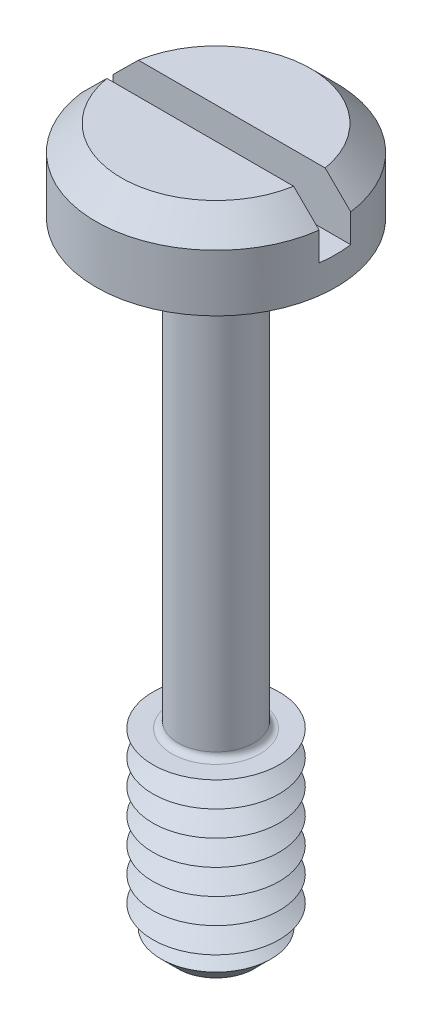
ISO-10303-21;
HEADER;
FILE_DESCRIPTION(('STEP AP214'),'2;1');
FILE_NAME('part.step','',(''),(''),'','','');
FILE_SCHEMA(('AUTOMOTIVE_DESIGN { 1 0 10303 214 1 1 1 1 }'));
ENDSEC;
DATA;
#1=APPLICATION_CONTEXT('core data for automotive mechanical design processes');
#2=APPLICATION_PROTOCOL_DEFINITION('international standard','automotive_design',2000,#1);
#3=PRODUCT_CONTEXT('',#1,'mechanical');
#4=PRODUCT('Part','Part','',(#3));
#5=PRODUCT_RELATED_PRODUCT_CATEGORY('part','',(#4));
#6=PRODUCT_DEFINITION_FORMATION('','',#4);
#7=PRODUCT_DEFINITION_CONTEXT('part definition',#1,'design');
#8=PRODUCT_DEFINITION('design','',#6,#7);
#9=PRODUCT_DEFINITION_SHAPE('','',#8);
#10=(LENGTH_UNIT() NAMED_UNIT(*) SI_UNIT(.MILLI.,.METRE.));
#11=(NAMED_UNIT(*) PLANE_ANGLE_UNIT() SI_UNIT($,.RADIAN.));
#12=(NAMED_UNIT(*) SI_UNIT($,.STERADIAN.) SOLID_ANGLE_UNIT());
#13=UNCERTAINTY_MEASURE_WITH_UNIT(LENGTH_MEASURE(1.E-05),#10,'distance_accuracy_value','');
#14=(GEOMETRIC_REPRESENTATION_CONTEXT(3) GLOBAL_UNCERTAINTY_ASSIGNED_CONTEXT((#13)) GLOBAL_UNIT_ASSIGNED_CONTEXT((#10,
#11,#12)) REPRESENTATION_CONTEXT('',''));
#15=CARTESIAN_POINT('',(0.,0.,0.));
#16=DIRECTION('',(0.,0.,1.));
#17=DIRECTION('',(1.,0.,0.));
#18=AXIS2_PLACEMENT_3D('',#15,#16,#17);
#19=CARTESIAN_POINT('',(0.,1.3,0.));
#20=DIRECTION('',(0.,1.,0.));
#21=DIRECTION('',(0.,0.,1.));
#22=AXIS2_PLACEMENT_3D('',#19,#20,#21);
#23=PLANE('',#22);
#24=DIRECTION('',(-1.,0.,0.));
#25=VECTOR('',#24,1.);
#26=CARTESIAN_POINT('',(1.9,1.3,-0.25));
#27=LINE('',#26,#25);
#28=CARTESIAN_POINT('',(1.4790199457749,1.3,-0.25));
#29=VERTEX_POINT('',#28);
#30=CARTESIAN_POINT('',(-1.4790199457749,1.3,-0.25));
#31=VERTEX_POINT('',#30);
#32=EDGE_CURVE('E109',#29,#31,#27,.T.);
#33=ORIENTED_EDGE('',*,*,#32,.F.);
#34=CARTESIAN_POINT('',(0.,1.3,0.));
#35=DIRECTION('',(0.,1.,0.));
#36=DIRECTION('',(0.,0.,1.));
#37=AXIS2_PLACEMENT_3D('',#34,#35,#36);
#38=CIRCLE('',#37,1.5);
#39=EDGE_CURVE('E112',#29,#31,#38,.T.);
#40=ORIENTED_EDGE('',*,*,#39,.T.);
#41=EDGE_LOOP('',(#33,#40));
#42=FACE_BOUND('',#41,.T.);
#43=ADVANCED_FACE('F38',(#42),#23,.T.);
#44=CARTESIAN_POINT('',(0.,1.3,0.));
#45=DIRECTION('',(0.,-1.,0.));
#46=DIRECTION('',(0.,0.,-1.));
#47=AXIS2_PLACEMENT_3D('',#44,#45,#46);
#48=CONICAL_SURFACE('',#47,1.5,0.785398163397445);
#49=CARTESIAN_POINT('',(4.1853368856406,-1.39279678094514,-0.25));
#50=CARTESIAN_POINT('',(4.04229038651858,-1.25000682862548,-0.25));
#51=CARTESIAN_POINT('',(3.89923277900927,-1.10722799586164,-0.25));
#52=CARTESIAN_POINT('',(3.613079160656,-0.82170490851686,-0.25));
#53=CARTESIAN_POINT('',(3.46998314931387,-0.678960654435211,-0.25));
#54=CARTESIAN_POINT('',(3.1836962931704,-0.393478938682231,-0.25));
#55=CARTESIAN_POINT('',(3.04050543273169,-0.25074149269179,-0.25));
#56=CARTESIAN_POINT('',(2.75404923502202,0.0346548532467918,-0.25));
#57=CARTESIAN_POINT('',(2.61078389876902,0.177313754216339,-0.25));
#58=CARTESIAN_POINT('',(2.32055190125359,0.466067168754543,-0.25));
#59=CARTESIAN_POINT('',(2.17358212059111,0.612158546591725,-0.25));
#60=CARTESIAN_POINT('',(1.87941274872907,0.904121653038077,-0.25));
#61=CARTESIAN_POINT('',(1.73221314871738,1.04999337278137,-0.25));
#62=CARTESIAN_POINT('',(1.51107316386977,1.26842721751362,-0.25));
#63=CARTESIAN_POINT('',(1.43731034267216,1.34116907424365,-0.25));
#64=CARTESIAN_POINT('',(1.28959621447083,1.48646381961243,-0.25));
#65=CARTESIAN_POINT('',(1.21564490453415,1.55901670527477,-0.25));
#66=CARTESIAN_POINT('',(1.06743357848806,1.7037953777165,-0.25));
#67=CARTESIAN_POINT('',(0.993173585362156,1.77602118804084,-0.25));
#68=CARTESIAN_POINT('',(0.844093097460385,1.91989140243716,-0.25));
#69=CARTESIAN_POINT('',(0.769272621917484,1.99153582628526,-0.25));
#70=CARTESIAN_POINT('',(0.673453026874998,2.0816726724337,-0.25));
#71=CARTESIAN_POINT('',(0.653038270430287,2.10078477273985,-0.25));
#72=CARTESIAN_POINT('',(0.612082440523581,2.13887320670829,-0.25));
#73=CARTESIAN_POINT('',(0.591541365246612,2.15784953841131,-0.25));
#74=CARTESIAN_POINT('',(0.529771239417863,2.21444296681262,-0.25));
#75=CARTESIAN_POINT('',(0.488307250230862,2.25180787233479,-0.25));
#76=CARTESIAN_POINT('',(0.419663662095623,2.31168392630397,-0.25));
#77=CARTESIAN_POINT('',(0.392840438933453,2.33460285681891,-0.25));
#78=CARTESIAN_POINT('',(0.33832923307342,2.37961554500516,-0.25));
#79=CARTESIAN_POINT('',(0.310638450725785,2.40170598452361,-0.25));
#80=CARTESIAN_POINT('',(0.267983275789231,2.43362951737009,-0.25));
#81=CARTESIAN_POINT('',(0.253509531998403,2.44411383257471,-0.25));
#82=CARTESIAN_POINT('',(0.224109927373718,2.46442369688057,-0.25));
#83=CARTESIAN_POINT('',(0.209184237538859,2.47424949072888,-0.25));
#84=CARTESIAN_POINT('',(0.178776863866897,2.49288890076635,-0.25));
#85=CARTESIAN_POINT('',(0.163297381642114,2.50170604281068,-0.25));
#86=CARTESIAN_POINT('',(0.131578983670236,2.51781823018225,-0.25));
#87=CARTESIAN_POINT('',(0.115341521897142,2.52511605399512,-0.25));
#88=CARTESIAN_POINT('',(0.081699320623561,2.53745946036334,-0.25));
#89=CARTESIAN_POINT('',(0.0642805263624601,2.54246888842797,-0.25));
#90=CARTESIAN_POINT('',(0.0288639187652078,2.54892929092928,-0.25));
#91=CARTESIAN_POINT('',(0.0108708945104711,2.55040442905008,-0.25));
#92=CARTESIAN_POINT('',(-0.0250443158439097,2.54939473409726,-0.25));
#93=CARTESIAN_POINT('',(-0.0429661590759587,2.54689872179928,-0.25));
#94=CARTESIAN_POINT('',(-0.0781147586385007,2.53864961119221,-0.25));
#95=CARTESIAN_POINT('',(-0.0953356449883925,2.53287340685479,-0.25));
#96=CARTESIAN_POINT('',(-0.132199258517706,2.51779776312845,-0.25));
#97=CARTESIAN_POINT('',(-0.151639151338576,2.50802516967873,-0.25));
#98=CARTESIAN_POINT('',(-0.189519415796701,2.48667393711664,-0.25));
#99=CARTESIAN_POINT('',(-0.207957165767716,2.47509084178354,-0.25));
#100=CARTESIAN_POINT('',(-0.244227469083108,2.45076455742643,-0.25));
#101=CARTESIAN_POINT('',(-0.262054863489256,2.4380137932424,-0.25));
#102=CARTESIAN_POINT('',(-0.297164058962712,2.41183569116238,-0.25));
#103=CARTESIAN_POINT('',(-0.314446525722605,2.39840923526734,-0.25));
#104=CARTESIAN_POINT('',(-0.371053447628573,2.35323015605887,-0.25));
#105=CARTESIAN_POINT('',(-0.409598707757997,2.32050831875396,-0.25));
#106=CARTESIAN_POINT('',(-0.485753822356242,2.25398879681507,-0.25));
#107=CARTESIAN_POINT('',(-0.523363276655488,2.22019066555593,-0.25));
#108=CARTESIAN_POINT('',(-0.598084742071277,2.15194710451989,-0.25));
#109=CARTESIAN_POINT('',(-0.63519600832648,2.11750085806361,-0.25));
#110=CARTESIAN_POINT('',(-0.709072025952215,2.0482548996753,-0.25));
#111=CARTESIAN_POINT('',(-0.745836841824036,2.01345525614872,-0.25));
#112=CARTESIAN_POINT('',(-0.855349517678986,1.9091458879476,-0.25));
#113=CARTESIAN_POINT('',(-0.927775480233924,1.83929849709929,-0.25));
#114=CARTESIAN_POINT('',(-1.07215273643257,1.69921833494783,-0.25));
#115=CARTESIAN_POINT('',(-1.14410432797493,1.62898586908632,-0.25));
#116=CARTESIAN_POINT('',(-1.33992197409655,1.43719038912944,-0.25));
#117=CARTESIAN_POINT('',(-1.46354933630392,1.31538371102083,-0.25));
#118=CARTESIAN_POINT('',(-1.71048263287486,1.07144356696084,-0.25));
#119=CARTESIAN_POINT('',(-1.83378856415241,0.949310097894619,-0.25));
#120=CARTESIAN_POINT('',(-2.20352581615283,0.582566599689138,-0.25));
#121=CARTESIAN_POINT('',(-2.44969583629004,0.337693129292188,-0.25));
#122=CARTESIAN_POINT('',(-2.94423335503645,-0.154747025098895,-0.25));
#123=CARTESIAN_POINT('',(-3.19259832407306,-0.402316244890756,-0.25));
#124=CARTESIAN_POINT('',(-3.68909403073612,-0.897516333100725,-0.25));
#125=CARTESIAN_POINT('',(-3.93722481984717,-1.14514714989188,-0.25));
#126=CARTESIAN_POINT('',(-4.1853368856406,-1.39279678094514,-0.25));
#127=B_SPLINE_CURVE_WITH_KNOTS('',3,(#49,#50,#51,#52,#53,#54,#55,#56,#57,#58,#59,#60,#61,#62,
#63,#64,#65,#66,#67,#68,#69,#70,#71,#72,#73,#74,#75,#76,#77,#78,#79,#80,#81,#82,#83,#84,#85,#86,
#87,#88,#89,#90,#91,#92,#93,#94,#95,#96,#97,#98,#99,#100,#101,#102,#103,#104,#105,#106,#107,
#108,#109,#110,#111,#112,#113,#114,#115,#116,#117,#118,#119,#120,#121,#122,#123,#124,#125,#126),
.UNSPECIFIED.,.F.,.F.,(4,2,2,2,2,2,2,2,2,2,2,2,2,2,2,2,2,2,2,2,2,2,2,2,2,2,2,2,2,2,2,2,2,2,2,2,
2,2,4),(0.,0.606350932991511,1.2127101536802,1.81925643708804,2.42579463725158,3.04747398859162,
3.66917779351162,3.97996857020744,4.29076421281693,4.60153711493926,4.91229940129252,
4.99619332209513,5.08008845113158,5.24751495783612,5.35335108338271,5.45957361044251,
5.51317784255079,5.56676204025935,5.62015280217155,5.67344504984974,5.72755238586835,
5.78128872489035,5.83517660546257,5.88944887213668,5.95455572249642,6.01982542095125,
6.08555345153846,6.15119780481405,6.30282427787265,6.45451451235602,6.60641073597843,
6.75827809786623,7.06012987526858,7.36176945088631,7.88242595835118,8.40308744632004,
9.44475070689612,10.4967873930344,11.5484571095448),.UNSPECIFIED.);
#128=CARTESIAN_POINT('',(1.88348082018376,0.899999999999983,-0.25));
#129=VERTEX_POINT('',#128);
#130=EDGE_CURVE('E251',#129,#29,#127,.T.);
#131=ORIENTED_EDGE('',*,*,#130,.F.);
#132=CARTESIAN_POINT('',(0.,0.899999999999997,0.));
#133=DIRECTION('',(0.,1.,0.));
#134=DIRECTION('',(0.,0.,1.));
#135=AXIS2_PLACEMENT_3D('',#132,#133,#134);
#136=CIRCLE('',#135,1.9);
#137=CARTESIAN_POINT('',(-1.88348082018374,0.899999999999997,-0.25));
#138=VERTEX_POINT('',#137);
#139=EDGE_CURVE('E127',#138,#129,#136,.F.);
#140=ORIENTED_EDGE('',*,*,#139,.F.);
#141=EDGE_CURVE('E101',#31,#138,#127,.T.);
#142=ORIENTED_EDGE('',*,*,#141,.F.);
#143=ORIENTED_EDGE('',*,*,#39,.F.);
#144=EDGE_LOOP('',(#131,#140,#142,#143));
#145=FACE_BOUND('',#144,.T.);
#146=ADVANCED_FACE('F213',(#145),#48,.T.);
#147=CARTESIAN_POINT('',(0.,-10.,0.));
#148=DIRECTION('',(0.,1.,0.));
#149=DIRECTION('',(0.,0.,1.));
#150=AXIS2_PLACEMENT_3D('',#147,#148,#149);
#151=CYLINDRICAL_SURFACE('',#150,0.6);
#152=CARTESIAN_POINT('',(0.,-6.9,0.));
#153=DIRECTION('',(0.,-1.,0.));
#154=DIRECTION('',(0.,0.,-1.));
#155=AXIS2_PLACEMENT_3D('',#152,#153,#154);
#156=CIRCLE('',#155,0.6);
#157=CARTESIAN_POINT('',(0.,-6.9,-0.6));
#158=VERTEX_POINT('',#157);
#159=EDGE_CURVE('E122',#158,#158,#156,.F.);
#160=ORIENTED_EDGE('',*,*,#159,.T.);
#161=EDGE_LOOP('',(#160));
#162=FACE_BOUND('',#161,.T.);
#163=CARTESIAN_POINT('',(0.,-0.0999999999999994,0.));
#164=DIRECTION('',(0.,1.,0.));
#165=DIRECTION('',(0.,0.,1.));
#166=AXIS2_PLACEMENT_3D('',#163,#164,#165);
#167=CIRCLE('',#166,0.6);
#168=CARTESIAN_POINT('',(0.,-0.0999999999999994,0.6));
#169=VERTEX_POINT('',#168);
#170=EDGE_CURVE('E348',#169,#169,#167,.F.);
#171=ORIENTED_EDGE('',*,*,#170,.T.);
#172=EDGE_LOOP('',(#171));
#173=FACE_BOUND('',#172,.T.);
#174=ADVANCED_FACE('F209',(#162,#173),#151,.T.);
#175=CARTESIAN_POINT('',(0.,1.3,0.));
#176=DIRECTION('',(0.,-1.,0.));
#177=DIRECTION('',(0.,0.,-1.));
#178=AXIS2_PLACEMENT_3D('',#175,#176,#177);
#179=CYLINDRICAL_SURFACE('',#178,1.9);
#180=ORIENTED_EDGE('',*,*,#139,.T.);
#181=DIRECTION('',(0.,-1.,0.));
#182=VECTOR('',#181,1.);
#183=CARTESIAN_POINT('',(1.88348082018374,1.3,-0.25));
#184=LINE('',#183,#182);
#185=CARTESIAN_POINT('',(1.88348082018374,0.45,-0.25));
#186=VERTEX_POINT('',#185);
#187=EDGE_CURVE('E63',#129,#186,#184,.T.);
#188=ORIENTED_EDGE('',*,*,#187,.T.);
#189=CARTESIAN_POINT('',(0.,0.45,0.));
#190=DIRECTION('',(0.,1.,0.));
#191=DIRECTION('',(0.,0.,1.));
#192=AXIS2_PLACEMENT_3D('',#189,#190,#191);
#193=CIRCLE('',#192,1.9);
#194=CARTESIAN_POINT('',(1.88348082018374,0.45,0.25));
#195=VERTEX_POINT('',#194);
#196=EDGE_CURVE('E11',#195,#186,#193,.T.);
#197=ORIENTED_EDGE('',*,*,#196,.F.);
#198=DIRECTION('',(0.,-1.,0.));
#199=VECTOR('',#198,1.);
#200=CARTESIAN_POINT('',(1.88348082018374,1.3,0.25));
#201=LINE('',#200,#199);
#202=CARTESIAN_POINT('',(1.88348082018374,0.899999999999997,0.25));
#203=VERTEX_POINT('',#202);
#204=EDGE_CURVE('E266',#195,#203,#201,.F.);
#205=ORIENTED_EDGE('',*,*,#204,.T.);
#206=CARTESIAN_POINT('',(-1.88348082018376,0.899999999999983,0.25));
#207=VERTEX_POINT('',#206);
#208=EDGE_CURVE('E119',#203,#207,#136,.F.);
#209=ORIENTED_EDGE('',*,*,#208,.T.);
#210=DIRECTION('',(0.,-1.,0.));
#211=VECTOR('',#210,1.);
#212=CARTESIAN_POINT('',(-1.88348082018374,1.3,0.25));
#213=LINE('',#212,#211);
#214=CARTESIAN_POINT('',(-1.88348082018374,0.45,0.25));
#215=VERTEX_POINT('',#214);
#216=EDGE_CURVE('E95',#207,#215,#213,.T.);
#217=ORIENTED_EDGE('',*,*,#216,.T.);
#218=CARTESIAN_POINT('',(-1.88348082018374,0.45,-0.25));
#219=VERTEX_POINT('',#218);
#220=EDGE_CURVE('E43',#219,#215,#193,.T.);
#221=ORIENTED_EDGE('',*,*,#220,.F.);
#222=DIRECTION('',(0.,-1.,0.));
#223=VECTOR('',#222,1.);
#224=CARTESIAN_POINT('',(-1.88348082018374,1.3,-0.25));
#225=LINE('',#224,#223);
#226=EDGE_CURVE('E270',#219,#138,#225,.F.);
#227=ORIENTED_EDGE('',*,*,#226,.T.);
#228=EDGE_LOOP('',(#180,#188,#197,#205,#209,#217,#221,#227));
#229=FACE_BOUND('',#228,.T.);
#230=CARTESIAN_POINT('',(0.,0.,0.));
#231=DIRECTION('',(0.,1.,0.));
#232=DIRECTION('',(0.,0.,1.));
#233=AXIS2_PLACEMENT_3D('',#230,#231,#232);
#234=CIRCLE('',#233,1.9);
#235=CARTESIAN_POINT('',(0.,0.,1.9));
#236=VERTEX_POINT('',#235);
#237=EDGE_CURVE('E334',#236,#236,#234,.T.);
#238=ORIENTED_EDGE('',*,*,#237,.T.);
#239=EDGE_LOOP('',(#238));
#240=FACE_BOUND('',#239,.T.);
#241=ADVANCED_FACE('F212',(#229,#240),#179,.T.);
#242=DIRECTION('',(1.,0.,0.));
#243=VECTOR('',#242,1.);
#244=CARTESIAN_POINT('',(1.9,1.3,0.25));
#245=LINE('',#244,#243);
#246=CARTESIAN_POINT('',(-1.4790199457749,1.3,0.25));
#247=VERTEX_POINT('',#246);
#248=CARTESIAN_POINT('',(1.4790199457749,1.3,0.25));
#249=VERTEX_POINT('',#248);
#250=EDGE_CURVE('E55',#247,#249,#245,.T.);
#251=ORIENTED_EDGE('',*,*,#250,.F.);
#252=EDGE_CURVE('E107',#247,#249,#38,.T.);
#253=ORIENTED_EDGE('',*,*,#252,.T.);
#254=EDGE_LOOP('',(#251,#253));
#255=FACE_BOUND('',#254,.T.);
#256=ADVANCED_FACE('F106',(#255),#23,.T.);
#257=CARTESIAN_POINT('',(0.,0.,0.));
#258=DIRECTION('',(0.,1.,0.));
#259=DIRECTION('',(0.,0.,1.));
#260=AXIS2_PLACEMENT_3D('',#257,#258,#259);
#261=PLANE('',#260);
#262=CARTESIAN_POINT('',(0.,0.,0.));
#263=DIRECTION('',(0.,1.,0.));
#264=DIRECTION('',(0.,0.,1.));
#265=AXIS2_PLACEMENT_3D('',#262,#263,#264);
#266=CIRCLE('',#265,0.7);
#267=CARTESIAN_POINT('',(0.,0.,0.7));
#268=VERTEX_POINT('',#267);
#269=EDGE_CURVE('E113',#268,#268,#266,.T.);
#270=ORIENTED_EDGE('',*,*,#269,.T.);
#271=EDGE_LOOP('',(#270));
#272=FACE_BOUND('',#271,.T.);
#273=ORIENTED_EDGE('',*,*,#237,.F.);
#274=EDGE_LOOP('',(#273));
#275=FACE_BOUND('',#274,.T.);
#276=ADVANCED_FACE('F203',(#272,#275),#261,.F.);
#277=CARTESIAN_POINT('',(0.,-7.,0.));
#278=DIRECTION('',(0.,-1.,0.));
#279=DIRECTION('',(0.,0.,-1.));
#280=AXIS2_PLACEMENT_3D('',#277,#278,#279);
#281=PLANE('',#280);
#282=CARTESIAN_POINT('',(0.,-7.,0.));
#283=DIRECTION('',(0.,-1.,0.));
#284=DIRECTION('',(0.,0.,-1.));
#285=AXIS2_PLACEMENT_3D('',#282,#283,#284);
#286=CIRCLE('',#285,0.7);
#287=CARTESIAN_POINT('',(0.,-7.,-0.7));
#288=VERTEX_POINT('',#287);
#289=EDGE_CURVE('E341',#288,#288,#286,.T.);
#290=ORIENTED_EDGE('',*,*,#289,.T.);
#291=EDGE_LOOP('',(#290));
#292=FACE_BOUND('',#291,.T.);
#293=CARTESIAN_POINT('',(0.,-7.,0.));
#294=DIRECTION('',(0.,1.,0.));
#295=DIRECTION('',(0.,0.,1.));
#296=AXIS2_PLACEMENT_3D('',#293,#294,#295);
#297=CIRCLE('',#296,1.);
#298=CARTESIAN_POINT('',(0.,-7.,1.));
#299=VERTEX_POINT('',#298);
#300=EDGE_CURVE('E330',#299,#299,#297,.T.);
#301=ORIENTED_EDGE('',*,*,#300,.T.);
#302=EDGE_LOOP('',(#301));
#303=FACE_BOUND('',#302,.T.);
#304=ADVANCED_FACE('F199',(#292,#303),#281,.F.);
#305=CARTESIAN_POINT('',(0.,-7.2,0.));
#306=DIRECTION('',(0.,1.,0.));
#307=DIRECTION('',(0.,0.,1.));
#308=AXIS2_PLACEMENT_3D('',#305,#306,#307);
#309=CONICAL_SURFACE('',#308,0.653589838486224,1.0471975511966);
#310=ORIENTED_EDGE('',*,*,#300,.F.);
#311=EDGE_LOOP('',(#310));
#312=FACE_BOUND('',#311,.T.);
#313=CARTESIAN_POINT('',(0.,-7.2,0.));
#314=DIRECTION('',(0.,1.,0.));
#315=DIRECTION('',(0.,0.,1.));
#316=AXIS2_PLACEMENT_3D('',#313,#314,#315);
#317=CIRCLE('',#316,0.653589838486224);
#318=CARTESIAN_POINT('',(0.,-7.2,0.653589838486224));
#319=VERTEX_POINT('',#318);
#320=EDGE_CURVE('E326',#319,#319,#317,.T.);
#321=ORIENTED_EDGE('',*,*,#320,.T.);
#322=EDGE_LOOP('',(#321));
#323=FACE_BOUND('',#322,.T.);
#324=ADVANCED_FACE('F195',(#312,#323),#309,.T.);
#325=CARTESIAN_POINT('',(0.,-7.4,0.));
#326=DIRECTION('',(0.,-1.,0.));
#327=DIRECTION('',(0.,0.,-1.));
#328=AXIS2_PLACEMENT_3D('',#325,#326,#327);
#329=CONICAL_SURFACE('',#328,1.,1.0471975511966);
#330=ORIENTED_EDGE('',*,*,#320,.F.);
#331=EDGE_LOOP('',(#330));
#332=FACE_BOUND('',#331,.T.);
#333=CARTESIAN_POINT('',(0.,-7.4,0.));
#334=DIRECTION('',(0.,1.,0.));
#335=DIRECTION('',(0.,0.,1.));
#336=AXIS2_PLACEMENT_3D('',#333,#334,#335);
#337=CIRCLE('',#336,1.);
#338=CARTESIAN_POINT('',(0.,-7.4,1.));
#339=VERTEX_POINT('',#338);
#340=EDGE_CURVE('E323',#339,#339,#337,.T.);
#341=ORIENTED_EDGE('',*,*,#340,.T.);
#342=EDGE_LOOP('',(#341));
#343=FACE_BOUND('',#342,.T.);
#344=ADVANCED_FACE('F191',(#332,#343),#329,.T.);
#345=CARTESIAN_POINT('',(0.,-7.6,0.));
#346=DIRECTION('',(0.,1.,0.));
#347=DIRECTION('',(0.,0.,1.));
#348=AXIS2_PLACEMENT_3D('',#345,#346,#347);
#349=CONICAL_SURFACE('',#348,0.653589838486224,1.0471975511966);
#350=ORIENTED_EDGE('',*,*,#340,.F.);
#351=EDGE_LOOP('',(#350));
#352=FACE_BOUND('',#351,.T.);
#353=CARTESIAN_POINT('',(0.,-7.6,0.));
#354=DIRECTION('',(0.,1.,0.));
#355=DIRECTION('',(0.,0.,1.));
#356=AXIS2_PLACEMENT_3D('',#353,#354,#355);
#357=CIRCLE('',#356,0.653589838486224);
#358=CARTESIAN_POINT('',(0.,-7.6,0.653589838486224));
#359=VERTEX_POINT('',#358);
#360=EDGE_CURVE('E319',#359,#359,#357,.T.);
#361=ORIENTED_EDGE('',*,*,#360,.T.);
#362=EDGE_LOOP('',(#361));
#363=FACE_BOUND('',#362,.T.);
#364=ADVANCED_FACE('F187',(#352,#363),#349,.T.);
#365=CARTESIAN_POINT('',(0.,-7.8,0.));
#366=DIRECTION('',(0.,-1.,0.));
#367=DIRECTION('',(0.,0.,-1.));
#368=AXIS2_PLACEMENT_3D('',#365,#366,#367);
#369=CONICAL_SURFACE('',#368,1.,1.0471975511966);
#370=ORIENTED_EDGE('',*,*,#360,.F.);
#371=EDGE_LOOP('',(#370));
#372=FACE_BOUND('',#371,.T.);
#373=CARTESIAN_POINT('',(0.,-7.8,0.));
#374=DIRECTION('',(0.,1.,0.));
#375=DIRECTION('',(0.,0.,1.));
#376=AXIS2_PLACEMENT_3D('',#373,#374,#375);
#377=CIRCLE('',#376,1.);
#378=CARTESIAN_POINT('',(0.,-7.8,1.));
#379=VERTEX_POINT('',#378);
#380=EDGE_CURVE('E315',#379,#379,#377,.T.);
#381=ORIENTED_EDGE('',*,*,#380,.T.);
#382=EDGE_LOOP('',(#381));
#383=FACE_BOUND('',#382,.T.);
#384=ADVANCED_FACE('F183',(#372,#383),#369,.T.);
#385=CARTESIAN_POINT('',(0.,-8.,0.));
#386=DIRECTION('',(0.,1.,0.));
#387=DIRECTION('',(0.,0.,1.));
#388=AXIS2_PLACEMENT_3D('',#385,#386,#387);
#389=CONICAL_SURFACE('',#388,0.653589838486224,1.0471975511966);
#390=ORIENTED_EDGE('',*,*,#380,.F.);
#391=EDGE_LOOP('',(#390));
#392=FACE_BOUND('',#391,.T.);
#393=CARTESIAN_POINT('',(0.,-8.,0.));
#394=DIRECTION('',(0.,1.,0.));
#395=DIRECTION('',(0.,0.,1.));
#396=AXIS2_PLACEMENT_3D('',#393,#394,#395);
#397=CIRCLE('',#396,0.653589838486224);
#398=CARTESIAN_POINT('',(0.,-8.,0.653589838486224));
#399=VERTEX_POINT('',#398);
#400=EDGE_CURVE('E311',#399,#399,#397,.T.);
#401=ORIENTED_EDGE('',*,*,#400,.T.);
#402=EDGE_LOOP('',(#401));
#403=FACE_BOUND('',#402,.T.);
#404=ADVANCED_FACE('F179',(#392,#403),#389,.T.);
#405=CARTESIAN_POINT('',(0.,-8.2,0.));
#406=DIRECTION('',(0.,-1.,0.));
#407=DIRECTION('',(0.,0.,-1.));
#408=AXIS2_PLACEMENT_3D('',#405,#406,#407);
#409=CONICAL_SURFACE('',#408,1.,1.0471975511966);
#410=ORIENTED_EDGE('',*,*,#400,.F.);
#411=EDGE_LOOP('',(#410));
#412=FACE_BOUND('',#411,.T.);
#413=CARTESIAN_POINT('',(0.,-8.2,0.));
#414=DIRECTION('',(0.,1.,0.));
#415=DIRECTION('',(0.,0.,1.));
#416=AXIS2_PLACEMENT_3D('',#413,#414,#415);
#417=CIRCLE('',#416,1.);
#418=CARTESIAN_POINT('',(0.,-8.2,1.));
#419=VERTEX_POINT('',#418);
#420=EDGE_CURVE('E307',#419,#419,#417,.T.);
#421=ORIENTED_EDGE('',*,*,#420,.T.);
#422=EDGE_LOOP('',(#421));
#423=FACE_BOUND('',#422,.T.);
#424=ADVANCED_FACE('F175',(#412,#423),#409,.T.);
#425=CARTESIAN_POINT('',(0.,-8.4,0.));
#426=DIRECTION('',(0.,1.,0.));
#427=DIRECTION('',(0.,0.,1.));
#428=AXIS2_PLACEMENT_3D('',#425,#426,#427);
#429=CONICAL_SURFACE('',#428,0.653589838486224,1.0471975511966);
#430=ORIENTED_EDGE('',*,*,#420,.F.);
#431=EDGE_LOOP('',(#430));
#432=FACE_BOUND('',#431,.T.);
#433=CARTESIAN_POINT('',(0.,-8.4,0.));
#434=DIRECTION('',(0.,1.,0.));
#435=DIRECTION('',(0.,0.,1.));
#436=AXIS2_PLACEMENT_3D('',#433,#434,#435);
#437=CIRCLE('',#436,0.653589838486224);
#438=CARTESIAN_POINT('',(0.,-8.4,0.653589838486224));
#439=VERTEX_POINT('',#438);
#440=EDGE_CURVE('E303',#439,#439,#437,.T.);
#441=ORIENTED_EDGE('',*,*,#440,.T.);
#442=EDGE_LOOP('',(#441));
#443=FACE_BOUND('',#442,.T.);
#444=ADVANCED_FACE('F171',(#432,#443),#429,.T.);
#445=CARTESIAN_POINT('',(0.,-8.6,0.));
#446=DIRECTION('',(0.,-1.,0.));
#447=DIRECTION('',(0.,0.,-1.));
#448=AXIS2_PLACEMENT_3D('',#445,#446,#447);
#449=CONICAL_SURFACE('',#448,1.,1.0471975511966);
#450=ORIENTED_EDGE('',*,*,#440,.F.);
#451=EDGE_LOOP('',(#450));
#452=FACE_BOUND('',#451,.T.);
#453=CARTESIAN_POINT('',(0.,-8.6,0.));
#454=DIRECTION('',(0.,1.,0.));
#455=DIRECTION('',(0.,0.,1.));
#456=AXIS2_PLACEMENT_3D('',#453,#454,#455);
#457=CIRCLE('',#456,1.);
#458=CARTESIAN_POINT('',(0.,-8.6,1.));
#459=VERTEX_POINT('',#458);
#460=EDGE_CURVE('E299',#459,#459,#457,.T.);
#461=ORIENTED_EDGE('',*,*,#460,.T.);
#462=EDGE_LOOP('',(#461));
#463=FACE_BOUND('',#462,.T.);
#464=ADVANCED_FACE('F167',(#452,#463),#449,.T.);
#465=CARTESIAN_POINT('',(0.,-8.8,0.));
#466=DIRECTION('',(0.,1.,0.));
#467=DIRECTION('',(0.,0.,1.));
#468=AXIS2_PLACEMENT_3D('',#465,#466,#467);
#469=CONICAL_SURFACE('',#468,0.653589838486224,1.0471975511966);
#470=ORIENTED_EDGE('',*,*,#460,.F.);
#471=EDGE_LOOP('',(#470));
#472=FACE_BOUND('',#471,.T.);
#473=CARTESIAN_POINT('',(0.,-8.8,0.));
#474=DIRECTION('',(0.,1.,0.));
#475=DIRECTION('',(0.,0.,1.));
#476=AXIS2_PLACEMENT_3D('',#473,#474,#475);
#477=CIRCLE('',#476,0.653589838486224);
#478=CARTESIAN_POINT('',(0.,-8.8,0.653589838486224));
#479=VERTEX_POINT('',#478);
#480=EDGE_CURVE('E295',#479,#479,#477,.T.);
#481=ORIENTED_EDGE('',*,*,#480,.T.);
#482=EDGE_LOOP('',(#481));
#483=FACE_BOUND('',#482,.T.);
#484=ADVANCED_FACE('F163',(#472,#483),#469,.T.);
#485=CARTESIAN_POINT('',(0.,-9.,0.));
#486=DIRECTION('',(0.,-1.,0.));
#487=DIRECTION('',(0.,0.,-1.));
#488=AXIS2_PLACEMENT_3D('',#485,#486,#487);
#489=CONICAL_SURFACE('',#488,1.,1.0471975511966);
#490=ORIENTED_EDGE('',*,*,#480,.F.);
#491=EDGE_LOOP('',(#490));
#492=FACE_BOUND('',#491,.T.);
#493=CARTESIAN_POINT('',(0.,-9.,0.));
#494=DIRECTION('',(0.,1.,0.));
#495=DIRECTION('',(0.,0.,1.));
#496=AXIS2_PLACEMENT_3D('',#493,#494,#495);
#497=CIRCLE('',#496,1.);
#498=CARTESIAN_POINT('',(0.,-9.,1.));
#499=VERTEX_POINT('',#498);
#500=EDGE_CURVE('E291',#499,#499,#497,.T.);
#501=ORIENTED_EDGE('',*,*,#500,.T.);
#502=EDGE_LOOP('',(#501));
#503=FACE_BOUND('',#502,.T.);
#504=ADVANCED_FACE('F159',(#492,#503),#489,.T.);
#505=CARTESIAN_POINT('',(0.,-9.2,0.));
#506=DIRECTION('',(0.,1.,0.));
#507=DIRECTION('',(0.,0.,1.));
#508=AXIS2_PLACEMENT_3D('',#505,#506,#507);
#509=CONICAL_SURFACE('',#508,0.653589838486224,1.0471975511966);
#510=ORIENTED_EDGE('',*,*,#500,.F.);
#511=EDGE_LOOP('',(#510));
#512=FACE_BOUND('',#511,.T.);
#513=CARTESIAN_POINT('',(0.,-9.2,0.));
#514=DIRECTION('',(0.,1.,0.));
#515=DIRECTION('',(0.,0.,1.));
#516=AXIS2_PLACEMENT_3D('',#513,#514,#515);
#517=CIRCLE('',#516,0.653589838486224);
#518=CARTESIAN_POINT('',(0.,-9.2,0.653589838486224));
#519=VERTEX_POINT('',#518);
#520=EDGE_CURVE('E287',#519,#519,#517,.T.);
#521=ORIENTED_EDGE('',*,*,#520,.T.);
#522=EDGE_LOOP('',(#521));
#523=FACE_BOUND('',#522,.T.);
#524=ADVANCED_FACE('F155',(#512,#523),#509,.T.);
#525=CARTESIAN_POINT('',(0.,-9.4,0.));
#526=DIRECTION('',(0.,-1.,0.));
#527=DIRECTION('',(0.,0.,-1.));
#528=AXIS2_PLACEMENT_3D('',#525,#526,#527);
#529=CONICAL_SURFACE('',#528,1.,1.0471975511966);
#530=ORIENTED_EDGE('',*,*,#520,.F.);
#531=EDGE_LOOP('',(#530));
#532=FACE_BOUND('',#531,.T.);
#533=CARTESIAN_POINT('',(0.,-9.4,0.));
#534=DIRECTION('',(0.,1.,0.));
#535=DIRECTION('',(0.,0.,1.));
#536=AXIS2_PLACEMENT_3D('',#533,#534,#535);
#537=CIRCLE('',#536,1.);
#538=CARTESIAN_POINT('',(0.,-9.4,1.));
#539=VERTEX_POINT('',#538);
#540=EDGE_CURVE('E282',#539,#539,#537,.T.);
#541=ORIENTED_EDGE('',*,*,#540,.T.);
#542=EDGE_LOOP('',(#541));
#543=FACE_BOUND('',#542,.T.);
#544=ADVANCED_FACE('F151',(#532,#543),#529,.T.);
#545=CARTESIAN_POINT('',(0.,-9.6,0.));
#546=DIRECTION('',(0.,1.,0.));
#547=DIRECTION('',(0.,0.,1.));
#548=AXIS2_PLACEMENT_3D('',#545,#546,#547);
#549=CONICAL_SURFACE('',#548,0.653589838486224,1.0471975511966);
#550=ORIENTED_EDGE('',*,*,#540,.F.);
#551=EDGE_LOOP('',(#550));
#552=FACE_BOUND('',#551,.T.);
#553=CARTESIAN_POINT('',(0.,-9.6,0.));
#554=DIRECTION('',(0.,1.,0.));
#555=DIRECTION('',(0.,0.,1.));
#556=AXIS2_PLACEMENT_3D('',#553,#554,#555);
#557=CIRCLE('',#556,0.653589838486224);
#558=CARTESIAN_POINT('',(0.,-9.6,0.653589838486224));
#559=VERTEX_POINT('',#558);
#560=EDGE_CURVE('E278',#559,#559,#557,.T.);
#561=ORIENTED_EDGE('',*,*,#560,.T.);
#562=EDGE_LOOP('',(#561));
#563=FACE_BOUND('',#562,.T.);
#564=ADVANCED_FACE('F147',(#552,#563),#549,.T.);
#565=CARTESIAN_POINT('',(0.,-9.8,0.));
#566=DIRECTION('',(0.,-1.,0.));
#567=DIRECTION('',(0.,0.,-1.));
#568=AXIS2_PLACEMENT_3D('',#565,#566,#567);
#569=CONICAL_SURFACE('',#568,1.,1.0471975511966);
#570=CARTESIAN_POINT('',(0.,-9.72679491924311,0.));
#571=DIRECTION('',(0.,-1.,0.));
#572=DIRECTION('',(0.,0.,-1.));
#573=AXIS2_PLACEMENT_3D('',#570,#571,#572);
#574=CIRCLE('',#573,0.873205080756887);
#575=CARTESIAN_POINT('',(0.,-9.72679491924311,-0.873205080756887));
#576=VERTEX_POINT('',#575);
#577=EDGE_CURVE('E286',#576,#576,#574,.F.);
#578=ORIENTED_EDGE('',*,*,#577,.T.);
#579=EDGE_LOOP('',(#578));
#580=FACE_BOUND('',#579,.T.);
#581=ORIENTED_EDGE('',*,*,#560,.F.);
#582=EDGE_LOOP('',(#581));
#583=FACE_BOUND('',#582,.T.);
#584=ADVANCED_FACE('F143',(#580,#583),#569,.T.);
#585=CARTESIAN_POINT('',(0.,-10.,0.));
#586=DIRECTION('',(0.,-1.,0.));
#587=DIRECTION('',(0.,0.,-1.));
#588=AXIS2_PLACEMENT_3D('',#585,#586,#587);
#589=PLANE('',#588);
#590=CARTESIAN_POINT('',(0.,-10.,0.));
#591=DIRECTION('',(0.,-1.,0.));
#592=DIRECTION('',(0.,0.,-1.));
#593=AXIS2_PLACEMENT_3D('',#590,#591,#592);
#594=CIRCLE('',#593,0.6);
#595=CARTESIAN_POINT('',(0.,-10.,-0.6));
#596=VERTEX_POINT('',#595);
#597=EDGE_CURVE('E338',#596,#596,#594,.T.);
#598=ORIENTED_EDGE('',*,*,#597,.T.);
#599=EDGE_LOOP('',(#598));
#600=FACE_BOUND('',#599,.T.);
#601=ADVANCED_FACE('F146',(#600),#589,.T.);
#602=CARTESIAN_POINT('',(0.,-10.,0.));
#603=DIRECTION('',(0.,1.,0.));
#604=DIRECTION('',(0.,0.,1.));
#605=AXIS2_PLACEMENT_3D('',#602,#603,#604);
#606=CONICAL_SURFACE('',#605,0.6,0.785398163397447);
#607=ORIENTED_EDGE('',*,*,#577,.F.);
#608=EDGE_LOOP('',(#607));
#609=FACE_BOUND('',#608,.T.);
#610=ORIENTED_EDGE('',*,*,#597,.F.);
#611=EDGE_LOOP('',(#610));
#612=FACE_BOUND('',#611,.T.);
#613=ADVANCED_FACE('F207',(#609,#612),#606,.T.);
#614=CARTESIAN_POINT('',(0.,-6.9,0.));
#615=DIRECTION('',(0.,-1.,0.));
#616=DIRECTION('',(0.,0.,-1.));
#617=AXIS2_PLACEMENT_3D('',#614,#615,#616);
#618=TOROIDAL_SURFACE('',#617,0.7,0.1);
#619=ORIENTED_EDGE('',*,*,#159,.F.);
#620=EDGE_LOOP('',(#619));
#621=FACE_BOUND('',#620,.T.);
#622=ORIENTED_EDGE('',*,*,#289,.F.);
#623=EDGE_LOOP('',(#622));
#624=FACE_BOUND('',#623,.T.);
#625=ADVANCED_FACE('F225',(#621,#624),#618,.F.);
#626=CARTESIAN_POINT('',(0.,-0.0999999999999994,0.));
#627=DIRECTION('',(0.,1.,0.));
#628=DIRECTION('',(0.,0.,1.));
#629=AXIS2_PLACEMENT_3D('',#626,#627,#628);
#630=TOROIDAL_SURFACE('',#629,0.7,0.1);
#631=ORIENTED_EDGE('',*,*,#269,.F.);
#632=EDGE_LOOP('',(#631));
#633=FACE_BOUND('',#632,.T.);
#634=ORIENTED_EDGE('',*,*,#170,.F.);
#635=EDGE_LOOP('',(#634));
#636=FACE_BOUND('',#635,.T.);
#637=ADVANCED_FACE('F228',(#633,#636),#630,.F.);
#638=CARTESIAN_POINT('',(-4.1853368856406,-1.39279678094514,0.25));
#639=CARTESIAN_POINT('',(-4.04229038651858,-1.25000682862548,0.25));
#640=CARTESIAN_POINT('',(-3.89923277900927,-1.10722799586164,0.25));
#641=CARTESIAN_POINT('',(-3.613079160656,-0.821704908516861,0.25));
#642=CARTESIAN_POINT('',(-3.46998314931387,-0.678960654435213,0.25));
#643=CARTESIAN_POINT('',(-3.1836962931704,-0.393478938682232,0.25));
#644=CARTESIAN_POINT('',(-3.04050543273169,-0.250741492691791,0.25));
#645=CARTESIAN_POINT('',(-2.75404923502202,0.0346548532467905,0.25));
#646=CARTESIAN_POINT('',(-2.61078389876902,0.177313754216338,0.25));
#647=CARTESIAN_POINT('',(-2.32055190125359,0.466067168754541,0.25));
#648=CARTESIAN_POINT('',(-2.17358212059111,0.612158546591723,0.25));
#649=CARTESIAN_POINT('',(-1.87941274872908,0.904121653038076,0.25));
#650=CARTESIAN_POINT('',(-1.73221314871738,1.04999337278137,0.25));
#651=CARTESIAN_POINT('',(-1.51107316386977,1.26842721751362,0.25));
#652=CARTESIAN_POINT('',(-1.43731034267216,1.34116907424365,0.25));
#653=CARTESIAN_POINT('',(-1.28959621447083,1.48646381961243,0.25));
#654=CARTESIAN_POINT('',(-1.21564490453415,1.55901670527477,0.25));
#655=CARTESIAN_POINT('',(-1.06743357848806,1.7037953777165,0.25));
#656=CARTESIAN_POINT('',(-0.993173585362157,1.77602118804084,0.25));
#657=CARTESIAN_POINT('',(-0.844093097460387,1.91989140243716,0.25));
#658=CARTESIAN_POINT('',(-0.769272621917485,1.99153582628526,0.25));
#659=CARTESIAN_POINT('',(-0.673453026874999,2.0816726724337,0.25));
#660=CARTESIAN_POINT('',(-0.653038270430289,2.10078477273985,0.25));
#661=CARTESIAN_POINT('',(-0.612082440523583,2.13887320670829,0.25));
#662=CARTESIAN_POINT('',(-0.591541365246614,2.1578495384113,0.25));
#663=CARTESIAN_POINT('',(-0.529771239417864,2.21444296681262,0.25));
#664=CARTESIAN_POINT('',(-0.488307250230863,2.25180787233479,0.25));
#665=CARTESIAN_POINT('',(-0.419663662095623,2.31168392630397,0.25));
#666=CARTESIAN_POINT('',(-0.392840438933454,2.33460285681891,0.25));
#667=CARTESIAN_POINT('',(-0.338329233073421,2.37961554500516,0.25));
#668=CARTESIAN_POINT('',(-0.310638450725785,2.40170598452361,0.25));
#669=CARTESIAN_POINT('',(-0.267983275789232,2.43362951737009,0.25));
#670=CARTESIAN_POINT('',(-0.253509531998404,2.44411383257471,0.25));
#671=CARTESIAN_POINT('',(-0.22410992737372,2.46442369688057,0.25));
#672=CARTESIAN_POINT('',(-0.209184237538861,2.47424949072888,0.25));
#673=CARTESIAN_POINT('',(-0.178776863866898,2.49288890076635,0.25));
#674=CARTESIAN_POINT('',(-0.163297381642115,2.50170604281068,0.25));
#675=CARTESIAN_POINT('',(-0.131578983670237,2.51781823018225,0.25));
#676=CARTESIAN_POINT('',(-0.115341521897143,2.52511605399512,0.25));
#677=CARTESIAN_POINT('',(-0.0816993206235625,2.53745946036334,0.25));
#678=CARTESIAN_POINT('',(-0.0642805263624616,2.54246888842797,0.25));
#679=CARTESIAN_POINT('',(-0.0288639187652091,2.54892929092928,0.25));
#680=CARTESIAN_POINT('',(-0.0108708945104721,2.55040442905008,0.25));
#681=CARTESIAN_POINT('',(0.0250443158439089,2.54939473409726,0.25));
#682=CARTESIAN_POINT('',(0.0429661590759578,2.54689872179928,0.25));
#683=CARTESIAN_POINT('',(0.0781147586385,2.53864961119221,0.25));
#684=CARTESIAN_POINT('',(0.095335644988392,2.53287340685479,0.25));
#685=CARTESIAN_POINT('',(0.132199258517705,2.51779776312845,0.25));
#686=CARTESIAN_POINT('',(0.151639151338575,2.50802516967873,0.25));
#687=CARTESIAN_POINT('',(0.1895194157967,2.48667393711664,0.25));
#688=CARTESIAN_POINT('',(0.207957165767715,2.47509084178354,0.25));
#689=CARTESIAN_POINT('',(0.244227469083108,2.45076455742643,0.25));
#690=CARTESIAN_POINT('',(0.262054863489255,2.4380137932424,0.25));
#691=CARTESIAN_POINT('',(0.297164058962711,2.41183569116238,0.25));
#692=CARTESIAN_POINT('',(0.314446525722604,2.39840923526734,0.25));
#693=CARTESIAN_POINT('',(0.371053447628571,2.35323015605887,0.25));
#694=CARTESIAN_POINT('',(0.409598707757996,2.32050831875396,0.25));
#695=CARTESIAN_POINT('',(0.48575382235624,2.25398879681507,0.25));
#696=CARTESIAN_POINT('',(0.523363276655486,2.22019066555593,0.25));
#697=CARTESIAN_POINT('',(0.598084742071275,2.1519471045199,0.25));
#698=CARTESIAN_POINT('',(0.635196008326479,2.11750085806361,0.25));
#699=CARTESIAN_POINT('',(0.709072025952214,2.0482548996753,0.25));
#700=CARTESIAN_POINT('',(0.745836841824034,2.01345525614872,0.25));
#701=CARTESIAN_POINT('',(0.855349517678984,1.9091458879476,0.25));
#702=CARTESIAN_POINT('',(0.927775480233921,1.8392984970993,0.25));
#703=CARTESIAN_POINT('',(1.07215273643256,1.69921833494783,0.25));
#704=CARTESIAN_POINT('',(1.14410432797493,1.62898586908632,0.25));
#705=CARTESIAN_POINT('',(1.33992197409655,1.43719038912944,0.25));
#706=CARTESIAN_POINT('',(1.46354933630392,1.31538371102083,0.25));
#707=CARTESIAN_POINT('',(1.71048263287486,1.07144356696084,0.25));
#708=CARTESIAN_POINT('',(1.83378856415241,0.94931009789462,0.25));
#709=CARTESIAN_POINT('',(2.20352581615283,0.582566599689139,0.25));
#710=CARTESIAN_POINT('',(2.44969583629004,0.337693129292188,0.25));
#711=CARTESIAN_POINT('',(2.94423335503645,-0.154747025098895,0.25));
#712=CARTESIAN_POINT('',(3.19259832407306,-0.402316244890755,0.25));
#713=CARTESIAN_POINT('',(3.68909403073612,-0.897516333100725,0.25));
#714=CARTESIAN_POINT('',(3.93722481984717,-1.14514714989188,0.25));
#715=CARTESIAN_POINT('',(4.1853368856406,-1.39279678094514,0.25));
#716=B_SPLINE_CURVE_WITH_KNOTS('',3,(#638,#639,#640,#641,#642,#643,#644,#645,#646,#647,#648,
#649,#650,#651,#652,#653,#654,#655,#656,#657,#658,#659,#660,#661,#662,#663,#664,#665,#666,#667,
#668,#669,#670,#671,#672,#673,#674,#675,#676,#677,#678,#679,#680,#681,#682,#683,#684,#685,#686,
#687,#688,#689,#690,#691,#692,#693,#694,#695,#696,#697,#698,#699,#700,#701,#702,#703,#704,#705,
#706,#707,#708,#709,#710,#711,#712,#713,#714,#715),.UNSPECIFIED.,.F.,.F.,(4,2,2,2,2,2,2,2,2,2,2,
2,2,2,2,2,2,2,2,2,2,2,2,2,2,2,2,2,2,2,2,2,2,2,2,2,2,2,4),(0.,0.60635093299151,1.21271015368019,
1.81925643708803,2.42579463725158,3.04747398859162,3.66917779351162,3.97996857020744,
4.29076421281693,4.60153711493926,4.91229940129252,4.99619332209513,5.08008845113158,
5.24751495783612,5.35335108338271,5.45957361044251,5.51317784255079,5.56676204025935,
5.62015280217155,5.67344504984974,5.72755238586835,5.78128872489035,5.83517660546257,
5.88944887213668,5.95455572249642,6.01982542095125,6.08555345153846,6.15119780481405,
6.30282427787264,6.45451451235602,6.60641073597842,6.75827809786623,7.06012987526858,
7.36176945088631,7.88242595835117,8.40308744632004,9.44475070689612,10.4967873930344,
11.5484571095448),.UNSPECIFIED.);
#717=EDGE_CURVE('E91',#207,#247,#716,.T.);
#718=ORIENTED_EDGE('',*,*,#717,.F.);
#719=ORIENTED_EDGE('',*,*,#208,.F.);
#720=EDGE_CURVE('E102',#249,#203,#716,.T.);
#721=ORIENTED_EDGE('',*,*,#720,.F.);
#722=ORIENTED_EDGE('',*,*,#252,.F.);
#723=EDGE_LOOP('',(#718,#719,#721,#722));
#724=FACE_BOUND('',#723,.T.);
#725=ADVANCED_FACE('F40',(#724),#48,.T.);
#726=CARTESIAN_POINT('',(0.,0.45,0.));
#727=DIRECTION('',(0.,1.,0.));
#728=DIRECTION('',(0.,0.,1.));
#729=AXIS2_PLACEMENT_3D('',#726,#727,#728);
#730=PLANE('',#729);
#731=DIRECTION('',(1.,0.,0.));
#732=VECTOR('',#731,1.);
#733=CARTESIAN_POINT('',(1.9,0.45,0.25));
#734=LINE('',#733,#732);
#735=EDGE_CURVE('E248',#215,#195,#734,.T.);
#736=ORIENTED_EDGE('',*,*,#735,.T.);
#737=ORIENTED_EDGE('',*,*,#196,.T.);
#738=DIRECTION('',(-1.,0.,0.));
#739=VECTOR('',#738,1.);
#740=CARTESIAN_POINT('',(1.9,0.45,-0.25));
#741=LINE('',#740,#739);
#742=EDGE_CURVE('E263',#186,#219,#741,.T.);
#743=ORIENTED_EDGE('',*,*,#742,.T.);
#744=ORIENTED_EDGE('',*,*,#220,.T.);
#745=EDGE_LOOP('',(#736,#737,#743,#744));
#746=FACE_BOUND('',#745,.T.);
#747=ADVANCED_FACE('F235',(#746),#730,.T.);
#748=CARTESIAN_POINT('',(1.9,0.45,-0.25));
#749=DIRECTION('',(0.,0.,-1.));
#750=DIRECTION('',(-1.,0.,0.));
#751=AXIS2_PLACEMENT_3D('',#748,#749,#750);
#752=PLANE('',#751);
#753=ORIENTED_EDGE('',*,*,#130,.T.);
#754=ORIENTED_EDGE('',*,*,#32,.T.);
#755=ORIENTED_EDGE('',*,*,#141,.T.);
#756=ORIENTED_EDGE('',*,*,#226,.F.);
#757=ORIENTED_EDGE('',*,*,#742,.F.);
#758=ORIENTED_EDGE('',*,*,#187,.F.);
#759=EDGE_LOOP('',(#753,#754,#755,#756,#757,#758));
#760=FACE_BOUND('',#759,.T.);
#761=ADVANCED_FACE('F140',(#760),#752,.F.);
#762=CARTESIAN_POINT('',(1.9,0.45,0.25));
#763=DIRECTION('',(0.,0.,1.));
#764=DIRECTION('',(1.,0.,0.));
#765=AXIS2_PLACEMENT_3D('',#762,#763,#764);
#766=PLANE('',#765);
#767=ORIENTED_EDGE('',*,*,#717,.T.);
#768=ORIENTED_EDGE('',*,*,#250,.T.);
#769=ORIENTED_EDGE('',*,*,#720,.T.);
#770=ORIENTED_EDGE('',*,*,#204,.F.);
#771=ORIENTED_EDGE('',*,*,#735,.F.);
#772=ORIENTED_EDGE('',*,*,#216,.F.);
#773=EDGE_LOOP('',(#767,#768,#769,#770,#771,#772));
#774=FACE_BOUND('',#773,.T.);
#775=ADVANCED_FACE('F92',(#774),#766,.F.);
#776=CLOSED_SHELL('',(#43,#146,#174,#241,#256,#276,#304,#324,#344,#364,#384,#404,#424,#444,#464,
#484,#504,#524,#544,#564,#584,#601,#613,#625,#637,#725,#747,#761,#775));
#777=MANIFOLD_SOLID_BREP('B2',#776);
#778=ADVANCED_BREP_SHAPE_REPRESENTATION('',(#18,#777),#14);
#779=SHAPE_DEFINITION_REPRESENTATION(#9,#778);
ENDSEC;
END-ISO-10303-21;
